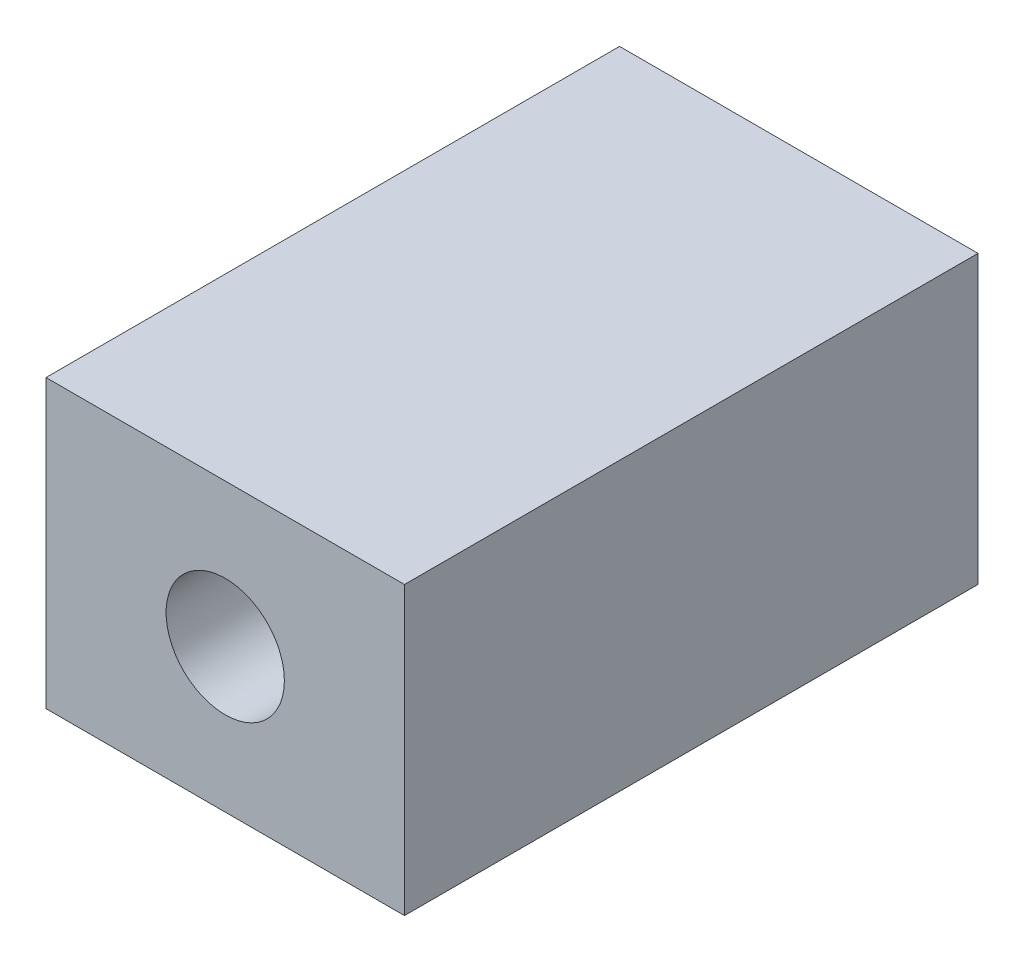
ISO-10303-21;
HEADER;
FILE_DESCRIPTION(('STEP AP214'),'2;1');
FILE_NAME('part.step','',(''),(''),'','','');
FILE_SCHEMA(('AUTOMOTIVE_DESIGN { 1 0 10303 214 1 1 1 1 }'));
ENDSEC;
DATA;
#1=APPLICATION_CONTEXT('core data for automotive mechanical design processes');
#2=APPLICATION_PROTOCOL_DEFINITION('international standard','automotive_design',2000,#1);
#3=PRODUCT_CONTEXT('',#1,'mechanical');
#4=PRODUCT('Part','Part','',(#3));
#5=PRODUCT_RELATED_PRODUCT_CATEGORY('part','',(#4));
#6=PRODUCT_DEFINITION_FORMATION('','',#4);
#7=PRODUCT_DEFINITION_CONTEXT('part definition',#1,'design');
#8=PRODUCT_DEFINITION('design','',#6,#7);
#9=PRODUCT_DEFINITION_SHAPE('','',#8);
#10=(LENGTH_UNIT() NAMED_UNIT(*) SI_UNIT(.MILLI.,.METRE.));
#11=(NAMED_UNIT(*) PLANE_ANGLE_UNIT() SI_UNIT($,.RADIAN.));
#12=(NAMED_UNIT(*) SI_UNIT($,.STERADIAN.) SOLID_ANGLE_UNIT());
#13=UNCERTAINTY_MEASURE_WITH_UNIT(LENGTH_MEASURE(1.E-05),#10,'distance_accuracy_value','');
#14=(GEOMETRIC_REPRESENTATION_CONTEXT(3) GLOBAL_UNCERTAINTY_ASSIGNED_CONTEXT((#13)) GLOBAL_UNIT_ASSIGNED_CONTEXT((#10,
#11,#12)) REPRESENTATION_CONTEXT('',''));
#15=CARTESIAN_POINT('',(0.,0.,0.));
#16=DIRECTION('',(0.,0.,1.));
#17=DIRECTION('',(1.,0.,0.));
#18=AXIS2_PLACEMENT_3D('',#15,#16,#17);
#19=CARTESIAN_POINT('',(5.,4.,16.));
#20=DIRECTION('',(-1.,0.,0.));
#21=DIRECTION('',(0.,-1.,0.));
#22=AXIS2_PLACEMENT_3D('',#19,#20,#21);
#23=PLANE('',#22);
#24=DIRECTION('',(0.,1.,0.));
#25=VECTOR('',#24,1.);
#26=CARTESIAN_POINT('',(5.,4.,0.));
#27=LINE('',#26,#25);
#28=CARTESIAN_POINT('',(5.,-4.,0.));
#29=VERTEX_POINT('',#28);
#30=CARTESIAN_POINT('',(5.,4.,0.));
#31=VERTEX_POINT('',#30);
#32=EDGE_CURVE('E104',#29,#31,#27,.T.);
#33=ORIENTED_EDGE('',*,*,#32,.T.);
#34=DIRECTION('',(0.,0.,-1.));
#35=VECTOR('',#34,1.);
#36=CARTESIAN_POINT('',(5.,4.,16.));
#37=LINE('',#36,#35);
#38=CARTESIAN_POINT('',(5.,4.,16.));
#39=VERTEX_POINT('',#38);
#40=EDGE_CURVE('E11',#39,#31,#37,.T.);
#41=ORIENTED_EDGE('',*,*,#40,.F.);
#42=DIRECTION('',(0.,1.,0.));
#43=VECTOR('',#42,1.);
#44=CARTESIAN_POINT('',(5.,4.,16.));
#45=LINE('',#44,#43);
#46=CARTESIAN_POINT('',(5.,-4.,16.));
#47=VERTEX_POINT('',#46);
#48=EDGE_CURVE('E92',#47,#39,#45,.T.);
#49=ORIENTED_EDGE('',*,*,#48,.F.);
#50=DIRECTION('',(0.,0.,-1.));
#51=VECTOR('',#50,1.);
#52=CARTESIAN_POINT('',(5.,-4.,16.));
#53=LINE('',#52,#51);
#54=EDGE_CURVE('E100',#47,#29,#53,.T.);
#55=ORIENTED_EDGE('',*,*,#54,.T.);
#56=EDGE_LOOP('',(#33,#41,#49,#55));
#57=FACE_BOUND('',#56,.T.);
#58=ADVANCED_FACE('F41',(#57),#23,.F.);
#59=CARTESIAN_POINT('',(-5.,4.,16.));
#60=DIRECTION('',(0.,-1.,0.));
#61=DIRECTION('',(0.,0.,-1.));
#62=AXIS2_PLACEMENT_3D('',#59,#60,#61);
#63=PLANE('',#62);
#64=DIRECTION('',(-1.,0.,0.));
#65=VECTOR('',#64,1.);
#66=CARTESIAN_POINT('',(-5.,4.,0.));
#67=LINE('',#66,#65);
#68=CARTESIAN_POINT('',(-5.,4.,0.));
#69=VERTEX_POINT('',#68);
#70=EDGE_CURVE('E96',#31,#69,#67,.T.);
#71=ORIENTED_EDGE('',*,*,#70,.T.);
#72=DIRECTION('',(0.,0.,-1.));
#73=VECTOR('',#72,1.);
#74=CARTESIAN_POINT('',(-5.,4.,16.));
#75=LINE('',#74,#73);
#76=CARTESIAN_POINT('',(-5.,4.,16.));
#77=VERTEX_POINT('',#76);
#78=EDGE_CURVE('E49',#77,#69,#75,.T.);
#79=ORIENTED_EDGE('',*,*,#78,.F.);
#80=DIRECTION('',(-1.,0.,0.));
#81=VECTOR('',#80,1.);
#82=CARTESIAN_POINT('',(-5.,4.,16.));
#83=LINE('',#82,#81);
#84=EDGE_CURVE('E87',#39,#77,#83,.T.);
#85=ORIENTED_EDGE('',*,*,#84,.F.);
#86=ORIENTED_EDGE('',*,*,#40,.T.);
#87=EDGE_LOOP('',(#71,#79,#85,#86));
#88=FACE_BOUND('',#87,.T.);
#89=ADVANCED_FACE('F95',(#88),#63,.F.);
#90=CARTESIAN_POINT('',(-5.,4.,16.));
#91=DIRECTION('',(1.,0.,0.));
#92=DIRECTION('',(0.,1.,0.));
#93=AXIS2_PLACEMENT_3D('',#90,#91,#92);
#94=PLANE('',#93);
#95=DIRECTION('',(0.,-1.,0.));
#96=VECTOR('',#95,1.);
#97=CARTESIAN_POINT('',(-5.,4.,0.));
#98=LINE('',#97,#96);
#99=CARTESIAN_POINT('',(-5.,-4.,0.));
#100=VERTEX_POINT('',#99);
#101=EDGE_CURVE('E74',#69,#100,#98,.T.);
#102=ORIENTED_EDGE('',*,*,#101,.T.);
#103=DIRECTION('',(0.,0.,-1.));
#104=VECTOR('',#103,1.);
#105=CARTESIAN_POINT('',(-5.,-4.,16.));
#106=LINE('',#105,#104);
#107=CARTESIAN_POINT('',(-5.,-4.,16.));
#108=VERTEX_POINT('',#107);
#109=EDGE_CURVE('E97',#108,#100,#106,.T.);
#110=ORIENTED_EDGE('',*,*,#109,.F.);
#111=DIRECTION('',(0.,-1.,0.));
#112=VECTOR('',#111,1.);
#113=CARTESIAN_POINT('',(-5.,4.,16.));
#114=LINE('',#113,#112);
#115=EDGE_CURVE('E90',#77,#108,#114,.T.);
#116=ORIENTED_EDGE('',*,*,#115,.F.);
#117=ORIENTED_EDGE('',*,*,#78,.T.);
#118=EDGE_LOOP('',(#102,#110,#116,#117));
#119=FACE_BOUND('',#118,.T.);
#120=ADVANCED_FACE('F98',(#119),#94,.F.);
#121=CARTESIAN_POINT('',(-5.,-4.,16.));
#122=DIRECTION('',(0.,1.,0.));
#123=DIRECTION('',(0.,0.,1.));
#124=AXIS2_PLACEMENT_3D('',#121,#122,#123);
#125=PLANE('',#124);
#126=DIRECTION('',(1.,0.,0.));
#127=VECTOR('',#126,1.);
#128=CARTESIAN_POINT('',(-5.,-4.,0.));
#129=LINE('',#128,#127);
#130=EDGE_CURVE('E80',#100,#29,#129,.T.);
#131=ORIENTED_EDGE('',*,*,#130,.T.);
#132=ORIENTED_EDGE('',*,*,#54,.F.);
#133=DIRECTION('',(1.,0.,0.));
#134=VECTOR('',#133,1.);
#135=CARTESIAN_POINT('',(-5.,-4.,16.));
#136=LINE('',#135,#134);
#137=EDGE_CURVE('E57',#108,#47,#136,.T.);
#138=ORIENTED_EDGE('',*,*,#137,.F.);
#139=ORIENTED_EDGE('',*,*,#109,.T.);
#140=EDGE_LOOP('',(#131,#132,#138,#139));
#141=FACE_BOUND('',#140,.T.);
#142=ADVANCED_FACE('F112',(#141),#125,.F.);
#143=CARTESIAN_POINT('',(0.,0.,16.));
#144=DIRECTION('',(0.,0.,1.));
#145=DIRECTION('',(1.,0.,0.));
#146=AXIS2_PLACEMENT_3D('',#143,#144,#145);
#147=PLANE('',#146);
#148=CARTESIAN_POINT('',(0.,0.,16.));
#149=DIRECTION('',(0.,0.,1.));
#150=DIRECTION('',(1.,0.,0.));
#151=AXIS2_PLACEMENT_3D('',#148,#149,#150);
#152=CIRCLE('',#151,1.64999999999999);
#153=CARTESIAN_POINT('',(1.64999999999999,0.,16.));
#154=VERTEX_POINT('',#153);
#155=EDGE_CURVE('E120',#154,#154,#152,.T.);
#156=ORIENTED_EDGE('',*,*,#155,.F.);
#157=EDGE_LOOP('',(#156));
#158=FACE_BOUND('',#157,.T.);
#159=ORIENTED_EDGE('',*,*,#48,.T.);
#160=ORIENTED_EDGE('',*,*,#84,.T.);
#161=ORIENTED_EDGE('',*,*,#115,.T.);
#162=ORIENTED_EDGE('',*,*,#137,.T.);
#163=EDGE_LOOP('',(#159,#160,#161,#162));
#164=FACE_BOUND('',#163,.T.);
#165=ADVANCED_FACE('F88',(#158,#164),#147,.T.);
#166=CARTESIAN_POINT('',(0.,0.,0.));
#167=DIRECTION('',(0.,0.,1.));
#168=DIRECTION('',(1.,0.,0.));
#169=AXIS2_PLACEMENT_3D('',#166,#167,#168);
#170=PLANE('',#169);
#171=CARTESIAN_POINT('',(0.,0.,0.));
#172=DIRECTION('',(0.,0.,1.));
#173=DIRECTION('',(1.,0.,0.));
#174=AXIS2_PLACEMENT_3D('',#171,#172,#173);
#175=CIRCLE('',#174,1.65);
#176=CARTESIAN_POINT('',(1.65,0.,0.));
#177=VERTEX_POINT('',#176);
#178=EDGE_CURVE('E107',#177,#177,#175,.T.);
#179=ORIENTED_EDGE('',*,*,#178,.T.);
#180=EDGE_LOOP('',(#179));
#181=FACE_BOUND('',#180,.T.);
#182=ORIENTED_EDGE('',*,*,#32,.F.);
#183=ORIENTED_EDGE('',*,*,#130,.F.);
#184=ORIENTED_EDGE('',*,*,#101,.F.);
#185=ORIENTED_EDGE('',*,*,#70,.F.);
#186=EDGE_LOOP('',(#182,#183,#184,#185));
#187=FACE_BOUND('',#186,.T.);
#188=ADVANCED_FACE('F115',(#181,#187),#170,.F.);
#189=CARTESIAN_POINT('',(0.,0.,16.));
#190=DIRECTION('',(0.,0.,1.));
#191=DIRECTION('',(1.,0.,0.));
#192=AXIS2_PLACEMENT_3D('',#189,#190,#191);
#193=CYLINDRICAL_SURFACE('',#192,1.64999999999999);
#194=ORIENTED_EDGE('',*,*,#178,.F.);
#195=EDGE_LOOP('',(#194));
#196=FACE_BOUND('',#195,.T.);
#197=ORIENTED_EDGE('',*,*,#155,.T.);
#198=EDGE_LOOP('',(#197));
#199=FACE_BOUND('',#198,.T.);
#200=ADVANCED_FACE('F124',(#196,#199),#193,.F.);
#201=CLOSED_SHELL('',(#58,#89,#120,#142,#165,#188,#200));
#202=MANIFOLD_SOLID_BREP('B2',#201);
#203=ADVANCED_BREP_SHAPE_REPRESENTATION('',(#18,#202),#14);
#204=SHAPE_DEFINITION_REPRESENTATION(#9,#203);
ENDSEC;
END-ISO-10303-21;
